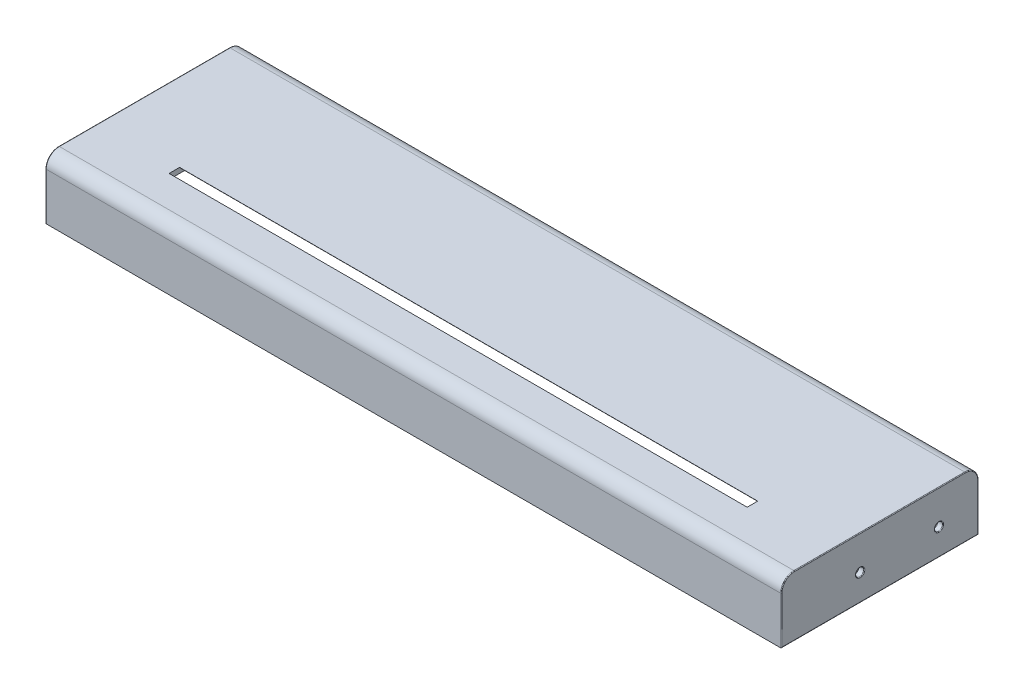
ISO-10303-21;
HEADER;
FILE_DESCRIPTION(('STEP AP214'),'2;1');
FILE_NAME('part.step','',(''),(''),'','','');
FILE_SCHEMA(('AUTOMOTIVE_DESIGN { 1 0 10303 214 1 1 1 1 }'));
ENDSEC;
DATA;
#1=APPLICATION_CONTEXT('core data for automotive mechanical design processes');
#2=APPLICATION_PROTOCOL_DEFINITION('international standard','automotive_design',2000,#1);
#3=PRODUCT_CONTEXT('',#1,'mechanical');
#4=PRODUCT('Part','Part','',(#3));
#5=PRODUCT_RELATED_PRODUCT_CATEGORY('part','',(#4));
#6=PRODUCT_DEFINITION_FORMATION('','',#4);
#7=PRODUCT_DEFINITION_CONTEXT('part definition',#1,'design');
#8=PRODUCT_DEFINITION('design','',#6,#7);
#9=PRODUCT_DEFINITION_SHAPE('','',#8);
#10=(LENGTH_UNIT() NAMED_UNIT(*) SI_UNIT(.MILLI.,.METRE.));
#11=(NAMED_UNIT(*) PLANE_ANGLE_UNIT() SI_UNIT($,.RADIAN.));
#12=(NAMED_UNIT(*) SI_UNIT($,.STERADIAN.) SOLID_ANGLE_UNIT());
#13=UNCERTAINTY_MEASURE_WITH_UNIT(LENGTH_MEASURE(1.E-05),#10,'distance_accuracy_value','');
#14=(GEOMETRIC_REPRESENTATION_CONTEXT(3) GLOBAL_UNCERTAINTY_ASSIGNED_CONTEXT((#13)) GLOBAL_UNIT_ASSIGNED_CONTEXT((#10,
#11,#12)) REPRESENTATION_CONTEXT('',''));
#15=CARTESIAN_POINT('',(0.,0.,0.));
#16=DIRECTION('',(0.,0.,1.));
#17=DIRECTION('',(1.,0.,0.));
#18=AXIS2_PLACEMENT_3D('',#15,#16,#17);
#19=CARTESIAN_POINT('',(280.,11.,37.5));
#20=DIRECTION('',(0.,1.,0.));
#21=DIRECTION('',(0.,0.,1.));
#22=AXIS2_PLACEMENT_3D('',#19,#20,#21);
#23=PLANE('',#22);
#24=DIRECTION('',(-1.,0.,0.));
#25=VECTOR('',#24,1.);
#26=CARTESIAN_POINT('',(280.,11.,-37.5));
#27=LINE('',#26,#25);
#28=CARTESIAN_POINT('',(279.75,11.,-37.5));
#29=VERTEX_POINT('',#28);
#30=CARTESIAN_POINT('',(0.249999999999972,11.,-37.5));
#31=VERTEX_POINT('',#30);
#32=EDGE_CURVE('E272',#29,#31,#27,.T.);
#33=ORIENTED_EDGE('',*,*,#32,.F.);
#34=DIRECTION('',(0.,0.,-1.));
#35=VECTOR('',#34,1.);
#36=CARTESIAN_POINT('',(279.75,11.,37.5));
#37=LINE('',#36,#35);
#38=CARTESIAN_POINT('',(279.75,11.,37.5));
#39=VERTEX_POINT('',#38);
#40=EDGE_CURVE('E327',#29,#39,#37,.F.);
#41=ORIENTED_EDGE('',*,*,#40,.T.);
#42=DIRECTION('',(-1.,0.,0.));
#43=VECTOR('',#42,1.);
#44=CARTESIAN_POINT('',(280.,11.,37.5));
#45=LINE('',#44,#43);
#46=CARTESIAN_POINT('',(0.249999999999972,11.,37.5));
#47=VERTEX_POINT('',#46);
#48=EDGE_CURVE('E275',#39,#47,#45,.T.);
#49=ORIENTED_EDGE('',*,*,#48,.T.);
#50=DIRECTION('',(0.,0.,-1.));
#51=VECTOR('',#50,1.);
#52=CARTESIAN_POINT('',(0.249999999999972,11.,37.5));
#53=LINE('',#52,#51);
#54=EDGE_CURVE('E325',#47,#31,#53,.T.);
#55=ORIENTED_EDGE('',*,*,#54,.T.);
#56=EDGE_LOOP('',(#33,#41,#49,#55));
#57=FACE_BOUND('',#56,.T.);
#58=DIRECTION('',(0.,0.,-1.));
#59=VECTOR('',#58,1.);
#60=CARTESIAN_POINT('',(2.,11.,37.5));
#61=LINE('',#60,#59);
#62=CARTESIAN_POINT('',(2.,11.,35.5));
#63=VERTEX_POINT('',#62);
#64=CARTESIAN_POINT('',(2.,11.,-35.5));
#65=VERTEX_POINT('',#64);
#66=EDGE_CURVE('E237',#63,#65,#61,.T.);
#67=ORIENTED_EDGE('',*,*,#66,.F.);
#68=DIRECTION('',(-1.,0.,0.));
#69=VECTOR('',#68,1.);
#70=CARTESIAN_POINT('',(280.,11.,35.5));
#71=LINE('',#70,#69);
#72=CARTESIAN_POINT('',(278.,11.,35.5));
#73=VERTEX_POINT('',#72);
#74=EDGE_CURVE('E225',#73,#63,#71,.T.);
#75=ORIENTED_EDGE('',*,*,#74,.F.);
#76=DIRECTION('',(0.,0.,-1.));
#77=VECTOR('',#76,1.);
#78=CARTESIAN_POINT('',(278.,11.,37.5));
#79=LINE('',#78,#77);
#80=CARTESIAN_POINT('',(278.,11.,-35.5));
#81=VERTEX_POINT('',#80);
#82=EDGE_CURVE('E240',#73,#81,#79,.T.);
#83=ORIENTED_EDGE('',*,*,#82,.T.);
#84=DIRECTION('',(-1.,0.,0.));
#85=VECTOR('',#84,1.);
#86=CARTESIAN_POINT('',(280.,11.,-35.5));
#87=LINE('',#86,#85);
#88=EDGE_CURVE('E252',#81,#65,#87,.T.);
#89=ORIENTED_EDGE('',*,*,#88,.T.);
#90=EDGE_LOOP('',(#67,#75,#83,#89));
#91=FACE_BOUND('',#90,.T.);
#92=ADVANCED_FACE('F33',(#57,#91),#23,.F.);
#93=CARTESIAN_POINT('',(280.,29.,32.5));
#94=DIRECTION('',(-1.,0.,0.));
#95=DIRECTION('',(0.,0.,1.));
#96=AXIS2_PLACEMENT_3D('',#93,#94,#95);
#97=CYLINDRICAL_SURFACE('',#96,5.);
#98=DIRECTION('',(-1.,0.,0.));
#99=VECTOR('',#98,1.);
#100=CARTESIAN_POINT('',(280.,29.,37.5));
#101=LINE('',#100,#99);
#102=CARTESIAN_POINT('',(279.75,29.,37.5));
#103=VERTEX_POINT('',#102);
#104=CARTESIAN_POINT('',(0.249999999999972,29.,37.5));
#105=VERTEX_POINT('',#104);
#106=EDGE_CURVE('E278',#103,#105,#101,.T.);
#107=ORIENTED_EDGE('',*,*,#106,.F.);
#108=CARTESIAN_POINT('',(279.75,29.,32.5));
#109=DIRECTION('',(1.,0.,0.));
#110=DIRECTION('',(0.,0.,-1.));
#111=AXIS2_PLACEMENT_3D('',#108,#109,#110);
#112=CIRCLE('',#111,5.);
#113=CARTESIAN_POINT('',(279.75,34.,32.5));
#114=VERTEX_POINT('',#113);
#115=EDGE_CURVE('E336',#103,#114,#112,.F.);
#116=ORIENTED_EDGE('',*,*,#115,.T.);
#117=DIRECTION('',(-1.,0.,0.));
#118=VECTOR('',#117,1.);
#119=CARTESIAN_POINT('',(280.,34.,32.5));
#120=LINE('',#119,#118);
#121=CARTESIAN_POINT('',(0.249999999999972,34.,32.5));
#122=VERTEX_POINT('',#121);
#123=EDGE_CURVE('E224',#114,#122,#120,.T.);
#124=ORIENTED_EDGE('',*,*,#123,.T.);
#125=CARTESIAN_POINT('',(0.249999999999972,29.,32.5));
#126=DIRECTION('',(1.,0.,0.));
#127=DIRECTION('',(0.,0.,-1.));
#128=AXIS2_PLACEMENT_3D('',#125,#126,#127);
#129=CIRCLE('',#128,5.);
#130=EDGE_CURVE('E334',#122,#105,#129,.T.);
#131=ORIENTED_EDGE('',*,*,#130,.T.);
#132=EDGE_LOOP('',(#107,#116,#124,#131));
#133=FACE_BOUND('',#132,.T.);
#134=ADVANCED_FACE('F414',(#133),#97,.T.);
#135=CARTESIAN_POINT('',(280.,29.,37.5));
#136=DIRECTION('',(0.,0.,-1.));
#137=DIRECTION('',(-1.,0.,0.));
#138=AXIS2_PLACEMENT_3D('',#135,#136,#137);
#139=PLANE('',#138);
#140=ORIENTED_EDGE('',*,*,#48,.F.);
#141=DIRECTION('',(0.,-1.,0.));
#142=VECTOR('',#141,1.);
#143=CARTESIAN_POINT('',(279.75,29.,37.5));
#144=LINE('',#143,#142);
#145=EDGE_CURVE('E332',#39,#103,#144,.F.);
#146=ORIENTED_EDGE('',*,*,#145,.T.);
#147=ORIENTED_EDGE('',*,*,#106,.T.);
#148=DIRECTION('',(0.,-1.,0.));
#149=VECTOR('',#148,1.);
#150=CARTESIAN_POINT('',(0.249999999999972,29.,37.5));
#151=LINE('',#150,#149);
#152=EDGE_CURVE('E329',#105,#47,#151,.T.);
#153=ORIENTED_EDGE('',*,*,#152,.T.);
#154=EDGE_LOOP('',(#140,#146,#147,#153));
#155=FACE_BOUND('',#154,.T.);
#156=ADVANCED_FACE('F419',(#155),#139,.F.);
#157=CARTESIAN_POINT('',(280.,29.,-37.5));
#158=DIRECTION('',(0.,0.,1.));
#159=DIRECTION('',(1.,0.,0.));
#160=AXIS2_PLACEMENT_3D('',#157,#158,#159);
#161=PLANE('',#160);
#162=DIRECTION('',(-1.,0.,0.));
#163=VECTOR('',#162,1.);
#164=CARTESIAN_POINT('',(280.,29.,-37.5));
#165=LINE('',#164,#163);
#166=CARTESIAN_POINT('',(279.75,29.,-37.5));
#167=VERTEX_POINT('',#166);
#168=CARTESIAN_POINT('',(0.249999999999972,29.,-37.5));
#169=VERTEX_POINT('',#168);
#170=EDGE_CURVE('E269',#167,#169,#165,.T.);
#171=ORIENTED_EDGE('',*,*,#170,.F.);
#172=DIRECTION('',(0.,1.,0.));
#173=VECTOR('',#172,1.);
#174=CARTESIAN_POINT('',(279.75,11.,-37.5));
#175=LINE('',#174,#173);
#176=EDGE_CURVE('E323',#167,#29,#175,.F.);
#177=ORIENTED_EDGE('',*,*,#176,.T.);
#178=ORIENTED_EDGE('',*,*,#32,.T.);
#179=DIRECTION('',(0.,1.,0.));
#180=VECTOR('',#179,1.);
#181=CARTESIAN_POINT('',(0.249999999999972,29.,-37.5));
#182=LINE('',#181,#180);
#183=EDGE_CURVE('E321',#31,#169,#182,.T.);
#184=ORIENTED_EDGE('',*,*,#183,.T.);
#185=EDGE_LOOP('',(#171,#177,#178,#184));
#186=FACE_BOUND('',#185,.T.);
#187=ADVANCED_FACE('F446',(#186),#161,.F.);
#188=CARTESIAN_POINT('',(280.,29.,-32.5));
#189=DIRECTION('',(-1.,0.,0.));
#190=DIRECTION('',(0.,0.,1.));
#191=AXIS2_PLACEMENT_3D('',#188,#189,#190);
#192=CYLINDRICAL_SURFACE('',#191,5.);
#193=DIRECTION('',(-1.,0.,0.));
#194=VECTOR('',#193,1.);
#195=CARTESIAN_POINT('',(280.,34.,-32.5));
#196=LINE('',#195,#194);
#197=CARTESIAN_POINT('',(279.75,34.,-32.5));
#198=VERTEX_POINT('',#197);
#199=CARTESIAN_POINT('',(0.249999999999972,34.,-32.5));
#200=VERTEX_POINT('',#199);
#201=EDGE_CURVE('E266',#198,#200,#196,.T.);
#202=ORIENTED_EDGE('',*,*,#201,.F.);
#203=CARTESIAN_POINT('',(279.75,29.,-32.5));
#204=DIRECTION('',(1.,0.,0.));
#205=DIRECTION('',(0.,0.,-1.));
#206=AXIS2_PLACEMENT_3D('',#203,#204,#205);
#207=CIRCLE('',#206,5.);
#208=EDGE_CURVE('E319',#198,#167,#207,.F.);
#209=ORIENTED_EDGE('',*,*,#208,.T.);
#210=ORIENTED_EDGE('',*,*,#170,.T.);
#211=CARTESIAN_POINT('',(0.249999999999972,29.,-32.5));
#212=DIRECTION('',(1.,0.,0.));
#213=DIRECTION('',(0.,0.,-1.));
#214=AXIS2_PLACEMENT_3D('',#211,#212,#213);
#215=CIRCLE('',#214,5.);
#216=EDGE_CURVE('E317',#169,#200,#215,.T.);
#217=ORIENTED_EDGE('',*,*,#216,.T.);
#218=EDGE_LOOP('',(#202,#209,#210,#217));
#219=FACE_BOUND('',#218,.T.);
#220=ADVANCED_FACE('F443',(#219),#192,.T.);
#221=CARTESIAN_POINT('',(280.,34.,32.5));
#222=DIRECTION('',(0.,-1.,0.));
#223=DIRECTION('',(0.,0.,-1.));
#224=AXIS2_PLACEMENT_3D('',#221,#222,#223);
#225=PLANE('',#224);
#226=DIRECTION('',(-1.,0.,0.));
#227=VECTOR('',#226,1.);
#228=CARTESIAN_POINT('',(30.,34.,16.5));
#229=LINE('',#228,#227);
#230=CARTESIAN_POINT('',(250.,34.,16.5));
#231=VERTEX_POINT('',#230);
#232=CARTESIAN_POINT('',(30.,34.,16.5));
#233=VERTEX_POINT('',#232);
#234=EDGE_CURVE('E203',#231,#233,#229,.T.);
#235=ORIENTED_EDGE('',*,*,#234,.F.);
#236=DIRECTION('',(0.,0.,-1.));
#237=VECTOR('',#236,1.);
#238=CARTESIAN_POINT('',(250.,34.,20.5));
#239=LINE('',#238,#237);
#240=CARTESIAN_POINT('',(250.,34.,20.5));
#241=VERTEX_POINT('',#240);
#242=EDGE_CURVE('E210',#241,#231,#239,.T.);
#243=ORIENTED_EDGE('',*,*,#242,.F.);
#244=DIRECTION('',(1.,0.,0.));
#245=VECTOR('',#244,1.);
#246=CARTESIAN_POINT('',(30.,34.,20.5));
#247=LINE('',#246,#245);
#248=CARTESIAN_POINT('',(30.,34.,20.5));
#249=VERTEX_POINT('',#248);
#250=EDGE_CURVE('E205',#249,#241,#247,.T.);
#251=ORIENTED_EDGE('',*,*,#250,.F.);
#252=DIRECTION('',(0.,0.,1.));
#253=VECTOR('',#252,1.);
#254=CARTESIAN_POINT('',(30.,34.,20.5));
#255=LINE('',#254,#253);
#256=EDGE_CURVE('E188',#233,#249,#255,.T.);
#257=ORIENTED_EDGE('',*,*,#256,.F.);
#258=EDGE_LOOP('',(#235,#243,#251,#257));
#259=FACE_BOUND('',#258,.T.);
#260=ORIENTED_EDGE('',*,*,#123,.F.);
#261=DIRECTION('',(0.,0.,1.));
#262=VECTOR('',#261,1.);
#263=CARTESIAN_POINT('',(279.75,34.,-32.5));
#264=LINE('',#263,#262);
#265=EDGE_CURVE('E314',#114,#198,#264,.F.);
#266=ORIENTED_EDGE('',*,*,#265,.T.);
#267=ORIENTED_EDGE('',*,*,#201,.T.);
#268=DIRECTION('',(0.,0.,1.));
#269=VECTOR('',#268,1.);
#270=CARTESIAN_POINT('',(0.249999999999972,34.,32.5));
#271=LINE('',#270,#269);
#272=EDGE_CURVE('E312',#200,#122,#271,.T.);
#273=ORIENTED_EDGE('',*,*,#272,.T.);
#274=EDGE_LOOP('',(#260,#266,#267,#273));
#275=FACE_BOUND('',#274,.T.);
#276=ADVANCED_FACE('F200',(#259,#275),#225,.F.);
#277=CARTESIAN_POINT('',(280.,29.,32.5));
#278=DIRECTION('',(1.,0.,0.));
#279=DIRECTION('',(0.,0.,-1.));
#280=AXIS2_PLACEMENT_3D('',#277,#278,#279);
#281=PLANE('',#280);
#282=CARTESIAN_POINT('',(280.,29.,-32.5));
#283=DIRECTION('',(1.,0.,0.));
#284=DIRECTION('',(0.,0.,-1.));
#285=AXIS2_PLACEMENT_3D('',#282,#283,#284);
#286=CIRCLE('',#285,4.75);
#287=CARTESIAN_POINT('',(280.,29.,-37.25));
#288=VERTEX_POINT('',#287);
#289=CARTESIAN_POINT('',(280.,33.75,-32.5));
#290=VERTEX_POINT('',#289);
#291=EDGE_CURVE('E307',#288,#290,#286,.T.);
#292=ORIENTED_EDGE('',*,*,#291,.T.);
#293=DIRECTION('',(0.,0.,1.));
#294=VECTOR('',#293,1.);
#295=CARTESIAN_POINT('',(280.,33.75,32.5));
#296=LINE('',#295,#294);
#297=CARTESIAN_POINT('',(280.,33.75,32.5));
#298=VERTEX_POINT('',#297);
#299=EDGE_CURVE('E309',#290,#298,#296,.T.);
#300=ORIENTED_EDGE('',*,*,#299,.T.);
#301=CARTESIAN_POINT('',(280.,29.,32.5));
#302=DIRECTION('',(1.,0.,0.));
#303=DIRECTION('',(0.,0.,-1.));
#304=AXIS2_PLACEMENT_3D('',#301,#302,#303);
#305=CIRCLE('',#304,4.75);
#306=CARTESIAN_POINT('',(280.,29.,37.25));
#307=VERTEX_POINT('',#306);
#308=EDGE_CURVE('E299',#298,#307,#305,.T.);
#309=ORIENTED_EDGE('',*,*,#308,.T.);
#310=DIRECTION('',(0.,-1.,0.));
#311=VECTOR('',#310,1.);
#312=CARTESIAN_POINT('',(280.,11.,37.25));
#313=LINE('',#312,#311);
#314=CARTESIAN_POINT('',(280.,11.25,37.25));
#315=VERTEX_POINT('',#314);
#316=EDGE_CURVE('E301',#307,#315,#313,.T.);
#317=ORIENTED_EDGE('',*,*,#316,.T.);
#318=DIRECTION('',(0.,0.,-1.));
#319=VECTOR('',#318,1.);
#320=CARTESIAN_POINT('',(280.,11.25,-37.5));
#321=LINE('',#320,#319);
#322=CARTESIAN_POINT('',(280.,11.25,-37.25));
#323=VERTEX_POINT('',#322);
#324=EDGE_CURVE('E303',#315,#323,#321,.T.);
#325=ORIENTED_EDGE('',*,*,#324,.T.);
#326=DIRECTION('',(0.,1.,0.));
#327=VECTOR('',#326,1.);
#328=CARTESIAN_POINT('',(280.,29.,-37.25));
#329=LINE('',#328,#327);
#330=EDGE_CURVE('E305',#323,#288,#329,.T.);
#331=ORIENTED_EDGE('',*,*,#330,.T.);
#332=EDGE_LOOP('',(#292,#300,#309,#317,#325,#331));
#333=FACE_BOUND('',#332,.T.);
#334=CARTESIAN_POINT('',(280.,21.,-22.5));
#335=DIRECTION('',(1.,0.,0.));
#336=DIRECTION('',(0.,0.,-1.));
#337=AXIS2_PLACEMENT_3D('',#334,#335,#336);
#338=CIRCLE('',#337,1.8);
#339=CARTESIAN_POINT('',(280.,21.,-24.3));
#340=VERTEX_POINT('',#339);
#341=EDGE_CURVE('E296',#340,#340,#338,.F.);
#342=ORIENTED_EDGE('',*,*,#341,.T.);
#343=EDGE_LOOP('',(#342));
#344=FACE_BOUND('',#343,.T.);
#345=CARTESIAN_POINT('',(280.,21.,7.50000000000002));
#346=DIRECTION('',(1.,0.,0.));
#347=DIRECTION('',(0.,0.,-1.));
#348=AXIS2_PLACEMENT_3D('',#345,#346,#347);
#349=CIRCLE('',#348,1.8);
#350=CARTESIAN_POINT('',(280.,21.,5.70000000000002));
#351=VERTEX_POINT('',#350);
#352=EDGE_CURVE('E195',#351,#351,#349,.F.);
#353=ORIENTED_EDGE('',*,*,#352,.T.);
#354=EDGE_LOOP('',(#353));
#355=FACE_BOUND('',#354,.T.);
#356=ADVANCED_FACE('F584',(#333,#344,#355),#281,.T.);
#357=CARTESIAN_POINT('',(0.,29.,32.5));
#358=DIRECTION('',(1.,0.,0.));
#359=DIRECTION('',(0.,0.,-1.));
#360=AXIS2_PLACEMENT_3D('',#357,#358,#359);
#361=PLANE('',#360);
#362=DIRECTION('',(0.,0.,-1.));
#363=VECTOR('',#362,1.);
#364=CARTESIAN_POINT('',(0.,11.25,32.5));
#365=LINE('',#364,#363);
#366=CARTESIAN_POINT('',(0.,11.25,-37.25));
#367=VERTEX_POINT('',#366);
#368=CARTESIAN_POINT('',(0.,11.25,37.25));
#369=VERTEX_POINT('',#368);
#370=EDGE_CURVE('E50',#367,#369,#365,.F.);
#371=ORIENTED_EDGE('',*,*,#370,.T.);
#372=DIRECTION('',(0.,-1.,0.));
#373=VECTOR('',#372,1.);
#374=CARTESIAN_POINT('',(0.,29.,37.25));
#375=LINE('',#374,#373);
#376=CARTESIAN_POINT('',(0.,29.,37.25));
#377=VERTEX_POINT('',#376);
#378=EDGE_CURVE('E358',#369,#377,#375,.F.);
#379=ORIENTED_EDGE('',*,*,#378,.T.);
#380=CARTESIAN_POINT('',(0.,29.,32.5));
#381=DIRECTION('',(1.,0.,0.));
#382=DIRECTION('',(0.,0.,-1.));
#383=AXIS2_PLACEMENT_3D('',#380,#381,#382);
#384=CIRCLE('',#383,4.75);
#385=CARTESIAN_POINT('',(0.,33.75,32.5));
#386=VERTEX_POINT('',#385);
#387=EDGE_CURVE('E350',#377,#386,#384,.F.);
#388=ORIENTED_EDGE('',*,*,#387,.T.);
#389=DIRECTION('',(0.,0.,1.));
#390=VECTOR('',#389,1.);
#391=CARTESIAN_POINT('',(0.,33.75,32.5));
#392=LINE('',#391,#390);
#393=CARTESIAN_POINT('',(0.,33.75,-32.5));
#394=VERTEX_POINT('',#393);
#395=EDGE_CURVE('E352',#386,#394,#392,.F.);
#396=ORIENTED_EDGE('',*,*,#395,.T.);
#397=CARTESIAN_POINT('',(0.,29.,-32.5));
#398=DIRECTION('',(1.,0.,0.));
#399=DIRECTION('',(0.,0.,-1.));
#400=AXIS2_PLACEMENT_3D('',#397,#398,#399);
#401=CIRCLE('',#400,4.75);
#402=CARTESIAN_POINT('',(0.,29.,-37.25));
#403=VERTEX_POINT('',#402);
#404=EDGE_CURVE('E354',#394,#403,#401,.F.);
#405=ORIENTED_EDGE('',*,*,#404,.T.);
#406=DIRECTION('',(0.,1.,0.));
#407=VECTOR('',#406,1.);
#408=CARTESIAN_POINT('',(0.,29.,-37.25));
#409=LINE('',#408,#407);
#410=EDGE_CURVE('E55',#403,#367,#409,.F.);
#411=ORIENTED_EDGE('',*,*,#410,.T.);
#412=EDGE_LOOP('',(#371,#379,#388,#396,#405,#411));
#413=FACE_BOUND('',#412,.T.);
#414=CARTESIAN_POINT('',(0.,21.,-22.5));
#415=DIRECTION('',(1.,0.,0.));
#416=DIRECTION('',(0.,0.,-1.));
#417=AXIS2_PLACEMENT_3D('',#414,#415,#416);
#418=CIRCLE('',#417,1.8);
#419=CARTESIAN_POINT('',(0.,21.,-24.3));
#420=VERTEX_POINT('',#419);
#421=EDGE_CURVE('E347',#420,#420,#418,.T.);
#422=ORIENTED_EDGE('',*,*,#421,.T.);
#423=EDGE_LOOP('',(#422));
#424=FACE_BOUND('',#423,.T.);
#425=CARTESIAN_POINT('',(0.,21.,7.50000000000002));
#426=DIRECTION('',(1.,0.,0.));
#427=DIRECTION('',(0.,0.,-1.));
#428=AXIS2_PLACEMENT_3D('',#425,#426,#427);
#429=CIRCLE('',#428,1.8);
#430=CARTESIAN_POINT('',(0.,21.,5.70000000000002));
#431=VERTEX_POINT('',#430);
#432=EDGE_CURVE('E344',#431,#431,#429,.T.);
#433=ORIENTED_EDGE('',*,*,#432,.T.);
#434=EDGE_LOOP('',(#433));
#435=FACE_BOUND('',#434,.T.);
#436=ADVANCED_FACE('F404',(#413,#424,#435),#361,.F.);
#437=CARTESIAN_POINT('',(280.,29.,32.5));
#438=DIRECTION('',(-1.,0.,0.));
#439=DIRECTION('',(0.,0.,1.));
#440=AXIS2_PLACEMENT_3D('',#437,#438,#439);
#441=CYLINDRICAL_SURFACE('',#440,3.);
#442=CARTESIAN_POINT('',(2.,29.,32.5));
#443=DIRECTION('',(1.,0.,0.));
#444=DIRECTION('',(0.,0.,-1.));
#445=AXIS2_PLACEMENT_3D('',#442,#443,#444);
#446=CIRCLE('',#445,3.);
#447=CARTESIAN_POINT('',(2.,32.,32.5));
#448=VERTEX_POINT('',#447);
#449=CARTESIAN_POINT('',(2.,29.,35.5));
#450=VERTEX_POINT('',#449);
#451=EDGE_CURVE('E217',#448,#450,#446,.T.);
#452=ORIENTED_EDGE('',*,*,#451,.F.);
#453=DIRECTION('',(-1.,0.,0.));
#454=VECTOR('',#453,1.);
#455=CARTESIAN_POINT('',(280.,32.,32.5));
#456=LINE('',#455,#454);
#457=CARTESIAN_POINT('',(278.,32.,32.5));
#458=VERTEX_POINT('',#457);
#459=EDGE_CURVE('E231',#458,#448,#456,.T.);
#460=ORIENTED_EDGE('',*,*,#459,.F.);
#461=CARTESIAN_POINT('',(278.,29.,32.5));
#462=DIRECTION('',(1.,0.,0.));
#463=DIRECTION('',(0.,0.,-1.));
#464=AXIS2_PLACEMENT_3D('',#461,#462,#463);
#465=CIRCLE('',#464,3.);
#466=CARTESIAN_POINT('',(278.,29.,35.5));
#467=VERTEX_POINT('',#466);
#468=EDGE_CURVE('E226',#458,#467,#465,.T.);
#469=ORIENTED_EDGE('',*,*,#468,.T.);
#470=DIRECTION('',(-1.,0.,0.));
#471=VECTOR('',#470,1.);
#472=CARTESIAN_POINT('',(280.,29.,35.5));
#473=LINE('',#472,#471);
#474=EDGE_CURVE('E221',#467,#450,#473,.T.);
#475=ORIENTED_EDGE('',*,*,#474,.T.);
#476=EDGE_LOOP('',(#452,#460,#469,#475));
#477=FACE_BOUND('',#476,.T.);
#478=ADVANCED_FACE('F559',(#477),#441,.F.);
#479=CARTESIAN_POINT('',(280.,29.,35.5));
#480=DIRECTION('',(0.,0.,-1.));
#481=DIRECTION('',(-1.,0.,0.));
#482=AXIS2_PLACEMENT_3D('',#479,#480,#481);
#483=PLANE('',#482);
#484=DIRECTION('',(0.,-1.,0.));
#485=VECTOR('',#484,1.);
#486=CARTESIAN_POINT('',(2.,29.,35.5));
#487=LINE('',#486,#485);
#488=EDGE_CURVE('E220',#450,#63,#487,.T.);
#489=ORIENTED_EDGE('',*,*,#488,.F.);
#490=ORIENTED_EDGE('',*,*,#474,.F.);
#491=DIRECTION('',(0.,-1.,0.));
#492=VECTOR('',#491,1.);
#493=CARTESIAN_POINT('',(278.,29.,35.5));
#494=LINE('',#493,#492);
#495=EDGE_CURVE('E229',#467,#73,#494,.T.);
#496=ORIENTED_EDGE('',*,*,#495,.T.);
#497=ORIENTED_EDGE('',*,*,#74,.T.);
#498=EDGE_LOOP('',(#489,#490,#496,#497));
#499=FACE_BOUND('',#498,.T.);
#500=ADVANCED_FACE('F562',(#499),#483,.T.);
#501=CARTESIAN_POINT('',(280.,29.,-35.5));
#502=DIRECTION('',(0.,0.,1.));
#503=DIRECTION('',(1.,0.,0.));
#504=AXIS2_PLACEMENT_3D('',#501,#502,#503);
#505=PLANE('',#504);
#506=DIRECTION('',(0.,1.,0.));
#507=VECTOR('',#506,1.);
#508=CARTESIAN_POINT('',(2.,29.,-35.5));
#509=LINE('',#508,#507);
#510=CARTESIAN_POINT('',(2.,29.,-35.5));
#511=VERTEX_POINT('',#510);
#512=EDGE_CURVE('E246',#65,#511,#509,.T.);
#513=ORIENTED_EDGE('',*,*,#512,.F.);
#514=ORIENTED_EDGE('',*,*,#88,.F.);
#515=DIRECTION('',(0.,1.,0.));
#516=VECTOR('',#515,1.);
#517=CARTESIAN_POINT('',(278.,29.,-35.5));
#518=LINE('',#517,#516);
#519=CARTESIAN_POINT('',(278.,29.,-35.5));
#520=VERTEX_POINT('',#519);
#521=EDGE_CURVE('E241',#81,#520,#518,.T.);
#522=ORIENTED_EDGE('',*,*,#521,.T.);
#523=DIRECTION('',(-1.,0.,0.));
#524=VECTOR('',#523,1.);
#525=CARTESIAN_POINT('',(280.,29.,-35.5));
#526=LINE('',#525,#524);
#527=EDGE_CURVE('E249',#520,#511,#526,.T.);
#528=ORIENTED_EDGE('',*,*,#527,.T.);
#529=EDGE_LOOP('',(#513,#514,#522,#528));
#530=FACE_BOUND('',#529,.T.);
#531=ADVANCED_FACE('F566',(#530),#505,.T.);
#532=CARTESIAN_POINT('',(280.,29.,-32.5));
#533=DIRECTION('',(-1.,0.,0.));
#534=DIRECTION('',(0.,0.,1.));
#535=AXIS2_PLACEMENT_3D('',#532,#533,#534);
#536=CYLINDRICAL_SURFACE('',#535,3.);
#537=CARTESIAN_POINT('',(2.,29.,-32.5));
#538=DIRECTION('',(1.,0.,0.));
#539=DIRECTION('',(0.,0.,-1.));
#540=AXIS2_PLACEMENT_3D('',#537,#538,#539);
#541=CIRCLE('',#540,3.);
#542=CARTESIAN_POINT('',(2.,32.,-32.5));
#543=VERTEX_POINT('',#542);
#544=EDGE_CURVE('E248',#511,#543,#541,.T.);
#545=ORIENTED_EDGE('',*,*,#544,.F.);
#546=ORIENTED_EDGE('',*,*,#527,.F.);
#547=CARTESIAN_POINT('',(278.,29.,-32.5));
#548=DIRECTION('',(1.,0.,0.));
#549=DIRECTION('',(0.,0.,-1.));
#550=AXIS2_PLACEMENT_3D('',#547,#548,#549);
#551=CIRCLE('',#550,3.);
#552=CARTESIAN_POINT('',(278.,32.,-32.5));
#553=VERTEX_POINT('',#552);
#554=EDGE_CURVE('E243',#520,#553,#551,.T.);
#555=ORIENTED_EDGE('',*,*,#554,.T.);
#556=DIRECTION('',(1.,0.,0.));
#557=VECTOR('',#556,1.);
#558=CARTESIAN_POINT('',(280.,32.,-32.5));
#559=LINE('',#558,#557);
#560=EDGE_CURVE('E234',#553,#543,#559,.F.);
#561=ORIENTED_EDGE('',*,*,#560,.T.);
#562=EDGE_LOOP('',(#545,#546,#555,#561));
#563=FACE_BOUND('',#562,.T.);
#564=ADVANCED_FACE('F570',(#563),#536,.F.);
#565=CARTESIAN_POINT('',(280.,32.,32.5));
#566=DIRECTION('',(0.,-1.,0.));
#567=DIRECTION('',(0.,0.,-1.));
#568=AXIS2_PLACEMENT_3D('',#565,#566,#567);
#569=PLANE('',#568);
#570=DIRECTION('',(0.,0.,-1.));
#571=VECTOR('',#570,1.);
#572=CARTESIAN_POINT('',(30.,32.,32.5));
#573=LINE('',#572,#571);
#574=CARTESIAN_POINT('',(30.,32.,24.5));
#575=VERTEX_POINT('',#574);
#576=CARTESIAN_POINT('',(30.,32.,12.5));
#577=VERTEX_POINT('',#576);
#578=EDGE_CURVE('E190',#575,#577,#573,.T.);
#579=ORIENTED_EDGE('',*,*,#578,.F.);
#580=DIRECTION('',(-1.,0.,0.));
#581=VECTOR('',#580,1.);
#582=CARTESIAN_POINT('',(250.,32.,24.5));
#583=LINE('',#582,#581);
#584=CARTESIAN_POINT('',(250.,32.,24.5));
#585=VERTEX_POINT('',#584);
#586=EDGE_CURVE('E286',#575,#585,#583,.F.);
#587=ORIENTED_EDGE('',*,*,#586,.T.);
#588=DIRECTION('',(0.,0.,1.));
#589=VECTOR('',#588,1.);
#590=CARTESIAN_POINT('',(250.,32.,32.5));
#591=LINE('',#590,#589);
#592=CARTESIAN_POINT('',(250.,32.,12.5));
#593=VERTEX_POINT('',#592);
#594=EDGE_CURVE('E282',#593,#585,#591,.T.);
#595=ORIENTED_EDGE('',*,*,#594,.F.);
#596=DIRECTION('',(1.,0.,0.));
#597=VECTOR('',#596,1.);
#598=CARTESIAN_POINT('',(30.,32.,12.5));
#599=LINE('',#598,#597);
#600=EDGE_CURVE('E284',#593,#577,#599,.F.);
#601=ORIENTED_EDGE('',*,*,#600,.T.);
#602=EDGE_LOOP('',(#579,#587,#595,#601));
#603=FACE_BOUND('',#602,.T.);
#604=DIRECTION('',(0.,0.,1.));
#605=VECTOR('',#604,1.);
#606=CARTESIAN_POINT('',(2.,32.,32.5));
#607=LINE('',#606,#605);
#608=EDGE_CURVE('E230',#543,#448,#607,.T.);
#609=ORIENTED_EDGE('',*,*,#608,.F.);
#610=ORIENTED_EDGE('',*,*,#560,.F.);
#611=DIRECTION('',(0.,0.,1.));
#612=VECTOR('',#611,1.);
#613=CARTESIAN_POINT('',(278.,32.,32.5));
#614=LINE('',#613,#612);
#615=EDGE_CURVE('E235',#553,#458,#614,.T.);
#616=ORIENTED_EDGE('',*,*,#615,.T.);
#617=ORIENTED_EDGE('',*,*,#459,.T.);
#618=EDGE_LOOP('',(#609,#610,#616,#617));
#619=FACE_BOUND('',#618,.T.);
#620=ADVANCED_FACE('F574',(#603,#619),#569,.T.);
#621=CARTESIAN_POINT('',(278.,29.,32.5));
#622=DIRECTION('',(1.,0.,0.));
#623=DIRECTION('',(0.,0.,-1.));
#624=AXIS2_PLACEMENT_3D('',#621,#622,#623);
#625=PLANE('',#624);
#626=CARTESIAN_POINT('',(278.,21.,7.50000000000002));
#627=DIRECTION('',(1.,0.,0.));
#628=DIRECTION('',(0.,0.,-1.));
#629=AXIS2_PLACEMENT_3D('',#626,#627,#628);
#630=CIRCLE('',#629,1.55);
#631=CARTESIAN_POINT('',(278.,21.,5.95000000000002));
#632=VERTEX_POINT('',#631);
#633=EDGE_CURVE('E527',#632,#632,#630,.F.);
#634=ORIENTED_EDGE('',*,*,#633,.F.);
#635=EDGE_LOOP('',(#634));
#636=FACE_BOUND('',#635,.T.);
#637=CARTESIAN_POINT('',(278.,21.,-22.5));
#638=DIRECTION('',(1.,0.,0.));
#639=DIRECTION('',(0.,0.,-1.));
#640=AXIS2_PLACEMENT_3D('',#637,#638,#639);
#641=CIRCLE('',#640,1.55);
#642=CARTESIAN_POINT('',(278.,21.,-24.05));
#643=VERTEX_POINT('',#642);
#644=EDGE_CURVE('E212',#643,#643,#641,.F.);
#645=ORIENTED_EDGE('',*,*,#644,.F.);
#646=EDGE_LOOP('',(#645));
#647=FACE_BOUND('',#646,.T.);
#648=ORIENTED_EDGE('',*,*,#468,.F.);
#649=ORIENTED_EDGE('',*,*,#615,.F.);
#650=ORIENTED_EDGE('',*,*,#554,.F.);
#651=ORIENTED_EDGE('',*,*,#521,.F.);
#652=ORIENTED_EDGE('',*,*,#82,.F.);
#653=ORIENTED_EDGE('',*,*,#495,.F.);
#654=EDGE_LOOP('',(#648,#649,#650,#651,#652,#653));
#655=FACE_BOUND('',#654,.T.);
#656=ADVANCED_FACE('F578',(#636,#647,#655),#625,.F.);
#657=CARTESIAN_POINT('',(2.,29.,32.5));
#658=DIRECTION('',(1.,0.,0.));
#659=DIRECTION('',(0.,0.,-1.));
#660=AXIS2_PLACEMENT_3D('',#657,#658,#659);
#661=PLANE('',#660);
#662=CARTESIAN_POINT('',(2.,21.,7.50000000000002));
#663=DIRECTION('',(1.,0.,0.));
#664=DIRECTION('',(0.,0.,-1.));
#665=AXIS2_PLACEMENT_3D('',#662,#663,#664);
#666=CIRCLE('',#665,1.55);
#667=CARTESIAN_POINT('',(2.,21.,5.95000000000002));
#668=VERTEX_POINT('',#667);
#669=EDGE_CURVE('E378',#668,#668,#666,.F.);
#670=ORIENTED_EDGE('',*,*,#669,.T.);
#671=EDGE_LOOP('',(#670));
#672=FACE_BOUND('',#671,.T.);
#673=CARTESIAN_POINT('',(2.,21.,-22.5));
#674=DIRECTION('',(1.,0.,0.));
#675=DIRECTION('',(0.,0.,-1.));
#676=AXIS2_PLACEMENT_3D('',#673,#674,#675);
#677=CIRCLE('',#676,1.55);
#678=CARTESIAN_POINT('',(2.,21.,-24.05));
#679=VERTEX_POINT('',#678);
#680=EDGE_CURVE('E529',#679,#679,#677,.F.);
#681=ORIENTED_EDGE('',*,*,#680,.T.);
#682=EDGE_LOOP('',(#681));
#683=FACE_BOUND('',#682,.T.);
#684=ORIENTED_EDGE('',*,*,#451,.T.);
#685=ORIENTED_EDGE('',*,*,#488,.T.);
#686=ORIENTED_EDGE('',*,*,#66,.T.);
#687=ORIENTED_EDGE('',*,*,#512,.T.);
#688=ORIENTED_EDGE('',*,*,#544,.T.);
#689=ORIENTED_EDGE('',*,*,#608,.T.);
#690=EDGE_LOOP('',(#684,#685,#686,#687,#688,#689));
#691=FACE_BOUND('',#690,.T.);
#692=ADVANCED_FACE('F538',(#672,#683,#691),#661,.T.);
#693=CARTESIAN_POINT('',(250.,24.,20.5));
#694=DIRECTION('',(1.,0.,0.));
#695=DIRECTION('',(0.,0.,-1.));
#696=AXIS2_PLACEMENT_3D('',#693,#694,#695);
#697=PLANE('',#696);
#698=ORIENTED_EDGE('',*,*,#594,.T.);
#699=CARTESIAN_POINT('',(250.,37.,24.5));
#700=DIRECTION('',(1.,0.,0.));
#701=DIRECTION('',(0.,0.,-1.));
#702=AXIS2_PLACEMENT_3D('',#699,#700,#701);
#703=CIRCLE('',#702,5.);
#704=EDGE_CURVE('E291',#585,#241,#703,.T.);
#705=ORIENTED_EDGE('',*,*,#704,.T.);
#706=ORIENTED_EDGE('',*,*,#242,.T.);
#707=CARTESIAN_POINT('',(250.,37.,12.5));
#708=DIRECTION('',(1.,0.,0.));
#709=DIRECTION('',(0.,0.,-1.));
#710=AXIS2_PLACEMENT_3D('',#707,#708,#709);
#711=CIRCLE('',#710,5.);
#712=EDGE_CURVE('E196',#231,#593,#711,.T.);
#713=ORIENTED_EDGE('',*,*,#712,.T.);
#714=EDGE_LOOP('',(#698,#705,#706,#713));
#715=FACE_BOUND('',#714,.T.);
#716=ADVANCED_FACE('F555',(#715),#697,.F.);
#717=CARTESIAN_POINT('',(30.,24.,20.5));
#718=DIRECTION('',(-1.,0.,0.));
#719=DIRECTION('',(0.,0.,1.));
#720=AXIS2_PLACEMENT_3D('',#717,#718,#719);
#721=PLANE('',#720);
#722=ORIENTED_EDGE('',*,*,#578,.T.);
#723=CARTESIAN_POINT('',(30.,37.,12.5));
#724=DIRECTION('',(-1.,0.,0.));
#725=DIRECTION('',(0.,0.,1.));
#726=AXIS2_PLACEMENT_3D('',#723,#724,#725);
#727=CIRCLE('',#726,5.);
#728=EDGE_CURVE('E184',#577,#233,#727,.T.);
#729=ORIENTED_EDGE('',*,*,#728,.T.);
#730=ORIENTED_EDGE('',*,*,#256,.T.);
#731=CARTESIAN_POINT('',(30.,37.,24.5));
#732=DIRECTION('',(-1.,0.,0.));
#733=DIRECTION('',(0.,0.,1.));
#734=AXIS2_PLACEMENT_3D('',#731,#732,#733);
#735=CIRCLE('',#734,5.);
#736=EDGE_CURVE('E289',#249,#575,#735,.T.);
#737=ORIENTED_EDGE('',*,*,#736,.T.);
#738=EDGE_LOOP('',(#722,#729,#730,#737));
#739=FACE_BOUND('',#738,.T.);
#740=ADVANCED_FACE('F186',(#739),#721,.F.);
#741=CARTESIAN_POINT('',(-0.000999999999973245,21.,-22.5));
#742=DIRECTION('',(1.,0.,0.));
#743=DIRECTION('',(0.,0.,-1.));
#744=AXIS2_PLACEMENT_3D('',#741,#742,#743);
#745=CYLINDRICAL_SURFACE('',#744,1.55);
#746=CARTESIAN_POINT('',(279.75,21.,-22.5));
#747=DIRECTION('',(1.,0.,0.));
#748=DIRECTION('',(0.,0.,-1.));
#749=AXIS2_PLACEMENT_3D('',#746,#747,#748);
#750=CIRCLE('',#749,1.55);
#751=CARTESIAN_POINT('',(279.75,21.,-24.05));
#752=VERTEX_POINT('',#751);
#753=EDGE_CURVE('E338',#752,#752,#750,.T.);
#754=ORIENTED_EDGE('',*,*,#753,.T.);
#755=EDGE_LOOP('',(#754));
#756=FACE_BOUND('',#755,.T.);
#757=ORIENTED_EDGE('',*,*,#644,.T.);
#758=EDGE_LOOP('',(#757));
#759=FACE_BOUND('',#758,.T.);
#760=ADVANCED_FACE('F523',(#756,#759),#745,.F.);
#761=CARTESIAN_POINT('',(-0.000999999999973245,21.,7.50000000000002));
#762=DIRECTION('',(1.,0.,0.));
#763=DIRECTION('',(0.,0.,-1.));
#764=AXIS2_PLACEMENT_3D('',#761,#762,#763);
#765=CYLINDRICAL_SURFACE('',#764,1.55);
#766=CARTESIAN_POINT('',(279.75,21.,7.50000000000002));
#767=DIRECTION('',(1.,0.,0.));
#768=DIRECTION('',(0.,0.,-1.));
#769=AXIS2_PLACEMENT_3D('',#766,#767,#768);
#770=CIRCLE('',#769,1.55);
#771=CARTESIAN_POINT('',(279.75,21.,5.95000000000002));
#772=VERTEX_POINT('',#771);
#773=EDGE_CURVE('E341',#772,#772,#770,.T.);
#774=ORIENTED_EDGE('',*,*,#773,.T.);
#775=EDGE_LOOP('',(#774));
#776=FACE_BOUND('',#775,.T.);
#777=ORIENTED_EDGE('',*,*,#633,.T.);
#778=EDGE_LOOP('',(#777));
#779=FACE_BOUND('',#778,.T.);
#780=ADVANCED_FACE('F489',(#776,#779),#765,.F.);
#781=CARTESIAN_POINT('',(30.,37.,24.5));
#782=DIRECTION('',(1.,0.,0.));
#783=DIRECTION('',(0.,0.,-1.));
#784=AXIS2_PLACEMENT_3D('',#781,#782,#783);
#785=CYLINDRICAL_SURFACE('',#784,5.);
#786=ORIENTED_EDGE('',*,*,#704,.F.);
#787=ORIENTED_EDGE('',*,*,#586,.F.);
#788=ORIENTED_EDGE('',*,*,#736,.F.);
#789=ORIENTED_EDGE('',*,*,#250,.T.);
#790=EDGE_LOOP('',(#786,#787,#788,#789));
#791=FACE_BOUND('',#790,.T.);
#792=ADVANCED_FACE('F486',(#791),#785,.T.);
#793=CARTESIAN_POINT('',(30.,37.,12.5));
#794=DIRECTION('',(-1.,0.,0.));
#795=DIRECTION('',(0.,0.,1.));
#796=AXIS2_PLACEMENT_3D('',#793,#794,#795);
#797=CYLINDRICAL_SURFACE('',#796,5.);
#798=ORIENTED_EDGE('',*,*,#728,.F.);
#799=ORIENTED_EDGE('',*,*,#600,.F.);
#800=ORIENTED_EDGE('',*,*,#712,.F.);
#801=ORIENTED_EDGE('',*,*,#234,.T.);
#802=EDGE_LOOP('',(#798,#799,#800,#801));
#803=FACE_BOUND('',#802,.T.);
#804=ADVANCED_FACE('F207',(#803),#797,.T.);
#805=CARTESIAN_POINT('',(280.001,21.,-22.5));
#806=DIRECTION('',(-1.,0.,0.));
#807=DIRECTION('',(0.,0.,1.));
#808=AXIS2_PLACEMENT_3D('',#805,#806,#807);
#809=CYLINDRICAL_SURFACE('',#808,1.55);
#810=CARTESIAN_POINT('',(0.249999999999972,21.,-22.5));
#811=DIRECTION('',(1.,0.,0.));
#812=DIRECTION('',(0.,0.,-1.));
#813=AXIS2_PLACEMENT_3D('',#810,#811,#812);
#814=CIRCLE('',#813,1.55);
#815=CARTESIAN_POINT('',(0.249999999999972,21.,-24.05));
#816=VERTEX_POINT('',#815);
#817=EDGE_CURVE('E42',#816,#816,#814,.F.);
#818=ORIENTED_EDGE('',*,*,#817,.T.);
#819=EDGE_LOOP('',(#818));
#820=FACE_BOUND('',#819,.T.);
#821=ORIENTED_EDGE('',*,*,#680,.F.);
#822=EDGE_LOOP('',(#821));
#823=FACE_BOUND('',#822,.T.);
#824=ADVANCED_FACE('F493',(#820,#823),#809,.F.);
#825=CARTESIAN_POINT('',(280.001,21.,7.50000000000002));
#826=DIRECTION('',(-1.,0.,0.));
#827=DIRECTION('',(0.,0.,1.));
#828=AXIS2_PLACEMENT_3D('',#825,#826,#827);
#829=CYLINDRICAL_SURFACE('',#828,1.55);
#830=CARTESIAN_POINT('',(0.249999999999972,21.,7.50000000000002));
#831=DIRECTION('',(1.,0.,0.));
#832=DIRECTION('',(0.,0.,-1.));
#833=AXIS2_PLACEMENT_3D('',#830,#831,#832);
#834=CIRCLE('',#833,1.55);
#835=CARTESIAN_POINT('',(0.249999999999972,21.,5.95000000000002));
#836=VERTEX_POINT('',#835);
#837=EDGE_CURVE('E11',#836,#836,#834,.F.);
#838=ORIENTED_EDGE('',*,*,#837,.T.);
#839=EDGE_LOOP('',(#838));
#840=FACE_BOUND('',#839,.T.);
#841=ORIENTED_EDGE('',*,*,#669,.F.);
#842=EDGE_LOOP('',(#841));
#843=FACE_BOUND('',#842,.T.);
#844=ADVANCED_FACE('F507',(#840,#843),#829,.F.);
#845=CARTESIAN_POINT('',(279.75,11.25,32.5));
#846=DIRECTION('',(0.,0.,1.));
#847=DIRECTION('',(1.,0.,0.));
#848=AXIS2_PLACEMENT_3D('',#845,#846,#847);
#849=CYLINDRICAL_SURFACE('',#848,0.25);
#850=CARTESIAN_POINT('',(279.75,11.25,37.25));
#851=DIRECTION('',(0.,0.707106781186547,0.707106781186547));
#852=DIRECTION('',(0.,0.707106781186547,-0.707106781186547));
#853=AXIS2_PLACEMENT_3D('',#850,#851,#852);
#854=ELLIPSE('',#853,0.353553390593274,0.25);
#855=EDGE_CURVE('E372',#39,#315,#854,.T.);
#856=ORIENTED_EDGE('',*,*,#855,.F.);
#857=ORIENTED_EDGE('',*,*,#40,.F.);
#858=CARTESIAN_POINT('',(279.75,11.25,-37.25));
#859=DIRECTION('',(0.,-0.707106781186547,0.707106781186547));
#860=DIRECTION('',(0.,0.707106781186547,0.707106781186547));
#861=AXIS2_PLACEMENT_3D('',#858,#859,#860);
#862=ELLIPSE('',#861,0.353553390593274,0.25);
#863=EDGE_CURVE('E375',#323,#29,#862,.F.);
#864=ORIENTED_EDGE('',*,*,#863,.F.);
#865=ORIENTED_EDGE('',*,*,#324,.F.);
#866=EDGE_LOOP('',(#856,#857,#864,#865));
#867=FACE_BOUND('',#866,.T.);
#868=ADVANCED_FACE('F455',(#867),#849,.T.);
#869=CARTESIAN_POINT('',(279.75,29.,-37.25));
#870=DIRECTION('',(0.,-1.,0.));
#871=DIRECTION('',(0.,0.,-1.));
#872=AXIS2_PLACEMENT_3D('',#869,#870,#871);
#873=CYLINDRICAL_SURFACE('',#872,0.25);
#874=ORIENTED_EDGE('',*,*,#863,.T.);
#875=ORIENTED_EDGE('',*,*,#176,.F.);
#876=CARTESIAN_POINT('',(279.75,29.,-37.25));
#877=DIRECTION('',(0.,1.,0.));
#878=DIRECTION('',(0.,0.,1.));
#879=AXIS2_PLACEMENT_3D('',#876,#877,#878);
#880=CIRCLE('',#879,0.25);
#881=EDGE_CURVE('E369',#288,#167,#880,.T.);
#882=ORIENTED_EDGE('',*,*,#881,.F.);
#883=ORIENTED_EDGE('',*,*,#330,.F.);
#884=EDGE_LOOP('',(#874,#875,#882,#883));
#885=FACE_BOUND('',#884,.T.);
#886=ADVANCED_FACE('F449',(#885),#873,.T.);
#887=CARTESIAN_POINT('',(279.75,29.,37.25));
#888=DIRECTION('',(0.,1.,0.));
#889=DIRECTION('',(0.,0.,1.));
#890=AXIS2_PLACEMENT_3D('',#887,#888,#889);
#891=CYLINDRICAL_SURFACE('',#890,0.25);
#892=ORIENTED_EDGE('',*,*,#855,.T.);
#893=ORIENTED_EDGE('',*,*,#316,.F.);
#894=CARTESIAN_POINT('',(279.75,29.,37.25));
#895=DIRECTION('',(0.,1.,0.));
#896=DIRECTION('',(0.,0.,1.));
#897=AXIS2_PLACEMENT_3D('',#894,#895,#896);
#898=CIRCLE('',#897,0.25);
#899=EDGE_CURVE('E366',#103,#307,#898,.T.);
#900=ORIENTED_EDGE('',*,*,#899,.F.);
#901=ORIENTED_EDGE('',*,*,#145,.F.);
#902=EDGE_LOOP('',(#892,#893,#900,#901));
#903=FACE_BOUND('',#902,.T.);
#904=ADVANCED_FACE('F423',(#903),#891,.T.);
#905=CARTESIAN_POINT('',(279.75,29.,-32.5));
#906=DIRECTION('',(1.,0.,0.));
#907=DIRECTION('',(0.,0.,-1.));
#908=AXIS2_PLACEMENT_3D('',#905,#906,#907);
#909=TOROIDAL_SURFACE('',#908,4.75,0.25);
#910=ORIENTED_EDGE('',*,*,#881,.T.);
#911=ORIENTED_EDGE('',*,*,#208,.F.);
#912=CARTESIAN_POINT('',(279.75,33.75,-32.5));
#913=DIRECTION('',(0.,0.,1.));
#914=DIRECTION('',(1.,0.,0.));
#915=AXIS2_PLACEMENT_3D('',#912,#913,#914);
#916=CIRCLE('',#915,0.25);
#917=EDGE_CURVE('E364',#290,#198,#916,.T.);
#918=ORIENTED_EDGE('',*,*,#917,.F.);
#919=ORIENTED_EDGE('',*,*,#291,.F.);
#920=EDGE_LOOP('',(#910,#911,#918,#919));
#921=FACE_BOUND('',#920,.T.);
#922=ADVANCED_FACE('F439',(#921),#909,.T.);
#923=CARTESIAN_POINT('',(279.75,29.,32.5));
#924=DIRECTION('',(1.,0.,0.));
#925=DIRECTION('',(0.,0.,-1.));
#926=AXIS2_PLACEMENT_3D('',#923,#924,#925);
#927=TOROIDAL_SURFACE('',#926,4.75,0.25);
#928=ORIENTED_EDGE('',*,*,#899,.T.);
#929=ORIENTED_EDGE('',*,*,#308,.F.);
#930=CARTESIAN_POINT('',(279.75,33.75,32.5));
#931=DIRECTION('',(0.,0.,-1.));
#932=DIRECTION('',(-1.,0.,0.));
#933=AXIS2_PLACEMENT_3D('',#930,#931,#932);
#934=CIRCLE('',#933,0.25);
#935=EDGE_CURVE('E362',#114,#298,#934,.T.);
#936=ORIENTED_EDGE('',*,*,#935,.F.);
#937=ORIENTED_EDGE('',*,*,#115,.F.);
#938=EDGE_LOOP('',(#928,#929,#936,#937));
#939=FACE_BOUND('',#938,.T.);
#940=ADVANCED_FACE('F429',(#939),#927,.T.);
#941=CARTESIAN_POINT('',(279.75,33.75,32.5));
#942=DIRECTION('',(0.,0.,-1.));
#943=DIRECTION('',(-1.,0.,0.));
#944=AXIS2_PLACEMENT_3D('',#941,#942,#943);
#945=CYLINDRICAL_SURFACE('',#944,0.25);
#946=ORIENTED_EDGE('',*,*,#917,.T.);
#947=ORIENTED_EDGE('',*,*,#265,.F.);
#948=ORIENTED_EDGE('',*,*,#935,.T.);
#949=ORIENTED_EDGE('',*,*,#299,.F.);
#950=EDGE_LOOP('',(#946,#947,#948,#949));
#951=FACE_BOUND('',#950,.T.);
#952=ADVANCED_FACE('F433',(#951),#945,.T.);
#953=CARTESIAN_POINT('',(279.75,21.,-22.5));
#954=DIRECTION('',(1.,0.,0.));
#955=DIRECTION('',(0.,0.,-1.));
#956=AXIS2_PLACEMENT_3D('',#953,#954,#955);
#957=TOROIDAL_SURFACE('',#956,1.8,0.25);
#958=ORIENTED_EDGE('',*,*,#341,.F.);
#959=EDGE_LOOP('',(#958));
#960=FACE_BOUND('',#959,.T.);
#961=ORIENTED_EDGE('',*,*,#753,.F.);
#962=EDGE_LOOP('',(#961));
#963=FACE_BOUND('',#962,.T.);
#964=ADVANCED_FACE('F496',(#960,#963),#957,.T.);
#965=CARTESIAN_POINT('',(279.75,21.,7.50000000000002));
#966=DIRECTION('',(1.,0.,0.));
#967=DIRECTION('',(0.,0.,-1.));
#968=AXIS2_PLACEMENT_3D('',#965,#966,#967);
#969=TOROIDAL_SURFACE('',#968,1.8,0.25);
#970=ORIENTED_EDGE('',*,*,#352,.F.);
#971=EDGE_LOOP('',(#970));
#972=FACE_BOUND('',#971,.T.);
#973=ORIENTED_EDGE('',*,*,#773,.F.);
#974=EDGE_LOOP('',(#973));
#975=FACE_BOUND('',#974,.T.);
#976=ADVANCED_FACE('F509',(#972,#975),#969,.T.);
#977=CARTESIAN_POINT('',(0.249999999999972,29.,-32.5));
#978=DIRECTION('',(1.,0.,0.));
#979=DIRECTION('',(0.,0.,-1.));
#980=AXIS2_PLACEMENT_3D('',#977,#978,#979);
#981=TOROIDAL_SURFACE('',#980,4.75,0.25);
#982=CARTESIAN_POINT('',(0.25,29.,-37.25));
#983=DIRECTION('',(0.,-1.,0.));
#984=DIRECTION('',(0.,0.,-1.));
#985=AXIS2_PLACEMENT_3D('',#982,#983,#984);
#986=CIRCLE('',#985,0.25);
#987=EDGE_CURVE('E388',#403,#169,#986,.T.);
#988=ORIENTED_EDGE('',*,*,#987,.F.);
#989=ORIENTED_EDGE('',*,*,#404,.F.);
#990=CARTESIAN_POINT('',(0.249999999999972,33.75,-32.5));
#991=DIRECTION('',(0.,0.,1.));
#992=DIRECTION('',(1.,0.,0.));
#993=AXIS2_PLACEMENT_3D('',#990,#991,#992);
#994=CIRCLE('',#993,0.25);
#995=EDGE_CURVE('E37',#200,#394,#994,.T.);
#996=ORIENTED_EDGE('',*,*,#995,.F.);
#997=ORIENTED_EDGE('',*,*,#216,.F.);
#998=EDGE_LOOP('',(#988,#989,#996,#997));
#999=FACE_BOUND('',#998,.T.);
#1000=ADVANCED_FACE('F403',(#999),#981,.T.);
#1001=CARTESIAN_POINT('',(0.249999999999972,33.75,32.5));
#1002=DIRECTION('',(0.,0.,1.));
#1003=DIRECTION('',(1.,0.,0.));
#1004=AXIS2_PLACEMENT_3D('',#1001,#1002,#1003);
#1005=CYLINDRICAL_SURFACE('',#1004,0.25);
#1006=ORIENTED_EDGE('',*,*,#995,.T.);
#1007=ORIENTED_EDGE('',*,*,#395,.F.);
#1008=CARTESIAN_POINT('',(0.249999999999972,33.75,32.5));
#1009=DIRECTION('',(0.,0.,1.));
#1010=DIRECTION('',(1.,0.,0.));
#1011=AXIS2_PLACEMENT_3D('',#1008,#1009,#1010);
#1012=CIRCLE('',#1011,0.25);
#1013=EDGE_CURVE('E386',#122,#386,#1012,.T.);
#1014=ORIENTED_EDGE('',*,*,#1013,.F.);
#1015=ORIENTED_EDGE('',*,*,#272,.F.);
#1016=EDGE_LOOP('',(#1006,#1007,#1014,#1015));
#1017=FACE_BOUND('',#1016,.T.);
#1018=ADVANCED_FACE('F398',(#1017),#1005,.T.);
#1019=CARTESIAN_POINT('',(0.249999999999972,29.,-37.25));
#1020=DIRECTION('',(0.,1.,0.));
#1021=DIRECTION('',(0.,0.,1.));
#1022=AXIS2_PLACEMENT_3D('',#1019,#1020,#1021);
#1023=CYLINDRICAL_SURFACE('',#1022,0.25);
#1024=ORIENTED_EDGE('',*,*,#987,.T.);
#1025=ORIENTED_EDGE('',*,*,#183,.F.);
#1026=CARTESIAN_POINT('',(0.249999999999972,11.25,-37.25));
#1027=DIRECTION('',(0.,0.707106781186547,-0.707106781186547));
#1028=DIRECTION('',(0.,0.707106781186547,0.707106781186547));
#1029=AXIS2_PLACEMENT_3D('',#1026,#1027,#1028);
#1030=ELLIPSE('',#1029,0.353553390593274,0.25);
#1031=EDGE_CURVE('E383',#367,#31,#1030,.F.);
#1032=ORIENTED_EDGE('',*,*,#1031,.F.);
#1033=ORIENTED_EDGE('',*,*,#410,.F.);
#1034=EDGE_LOOP('',(#1024,#1025,#1032,#1033));
#1035=FACE_BOUND('',#1034,.T.);
#1036=ADVANCED_FACE('F459',(#1035),#1023,.T.);
#1037=CARTESIAN_POINT('',(0.249999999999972,29.,32.5));
#1038=DIRECTION('',(1.,0.,0.));
#1039=DIRECTION('',(0.,0.,-1.));
#1040=AXIS2_PLACEMENT_3D('',#1037,#1038,#1039);
#1041=TOROIDAL_SURFACE('',#1040,4.75,0.25);
#1042=ORIENTED_EDGE('',*,*,#1013,.T.);
#1043=ORIENTED_EDGE('',*,*,#387,.F.);
#1044=CARTESIAN_POINT('',(0.249999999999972,29.,37.25));
#1045=DIRECTION('',(0.,-1.,0.));
#1046=DIRECTION('',(0.,0.,-1.));
#1047=AXIS2_PLACEMENT_3D('',#1044,#1045,#1046);
#1048=CIRCLE('',#1047,0.25);
#1049=EDGE_CURVE('E381',#105,#377,#1048,.T.);
#1050=ORIENTED_EDGE('',*,*,#1049,.F.);
#1051=ORIENTED_EDGE('',*,*,#130,.F.);
#1052=EDGE_LOOP('',(#1042,#1043,#1050,#1051));
#1053=FACE_BOUND('',#1052,.T.);
#1054=ADVANCED_FACE('F409',(#1053),#1041,.T.);
#1055=CARTESIAN_POINT('',(0.249999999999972,11.25,37.5));
#1056=DIRECTION('',(0.,0.,-1.));
#1057=DIRECTION('',(-1.,0.,0.));
#1058=AXIS2_PLACEMENT_3D('',#1055,#1056,#1057);
#1059=CYLINDRICAL_SURFACE('',#1058,0.25);
#1060=ORIENTED_EDGE('',*,*,#1031,.T.);
#1061=ORIENTED_EDGE('',*,*,#54,.F.);
#1062=CARTESIAN_POINT('',(0.249999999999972,11.25,37.25));
#1063=DIRECTION('',(0.,-0.707106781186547,-0.707106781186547));
#1064=DIRECTION('',(0.,0.707106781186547,-0.707106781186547));
#1065=AXIS2_PLACEMENT_3D('',#1062,#1063,#1064);
#1066=ELLIPSE('',#1065,0.353553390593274,0.25);
#1067=EDGE_CURVE('E379',#369,#47,#1066,.F.);
#1068=ORIENTED_EDGE('',*,*,#1067,.F.);
#1069=ORIENTED_EDGE('',*,*,#370,.F.);
#1070=EDGE_LOOP('',(#1060,#1061,#1068,#1069));
#1071=FACE_BOUND('',#1070,.T.);
#1072=ADVANCED_FACE('F461',(#1071),#1059,.T.);
#1073=CARTESIAN_POINT('',(0.249999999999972,29.,37.25));
#1074=DIRECTION('',(0.,-1.,0.));
#1075=DIRECTION('',(0.,0.,-1.));
#1076=AXIS2_PLACEMENT_3D('',#1073,#1074,#1075);
#1077=CYLINDRICAL_SURFACE('',#1076,0.25);
#1078=ORIENTED_EDGE('',*,*,#1049,.T.);
#1079=ORIENTED_EDGE('',*,*,#378,.F.);
#1080=ORIENTED_EDGE('',*,*,#1067,.T.);
#1081=ORIENTED_EDGE('',*,*,#152,.F.);
#1082=EDGE_LOOP('',(#1078,#1079,#1080,#1081));
#1083=FACE_BOUND('',#1082,.T.);
#1084=ADVANCED_FACE('F464',(#1083),#1077,.T.);
#1085=CARTESIAN_POINT('',(0.249999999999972,21.,-22.5));
#1086=DIRECTION('',(1.,0.,0.));
#1087=DIRECTION('',(0.,0.,-1.));
#1088=AXIS2_PLACEMENT_3D('',#1085,#1086,#1087);
#1089=TOROIDAL_SURFACE('',#1088,1.8,0.25);
#1090=ORIENTED_EDGE('',*,*,#421,.F.);
#1091=EDGE_LOOP('',(#1090));
#1092=FACE_BOUND('',#1091,.T.);
#1093=ORIENTED_EDGE('',*,*,#817,.F.);
#1094=EDGE_LOOP('',(#1093));
#1095=FACE_BOUND('',#1094,.T.);
#1096=ADVANCED_FACE('F466',(#1092,#1095),#1089,.T.);
#1097=CARTESIAN_POINT('',(0.249999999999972,21.,7.50000000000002));
#1098=DIRECTION('',(1.,0.,0.));
#1099=DIRECTION('',(0.,0.,-1.));
#1100=AXIS2_PLACEMENT_3D('',#1097,#1098,#1099);
#1101=TOROIDAL_SURFACE('',#1100,1.8,0.25);
#1102=ORIENTED_EDGE('',*,*,#432,.F.);
#1103=EDGE_LOOP('',(#1102));
#1104=FACE_BOUND('',#1103,.T.);
#1105=ORIENTED_EDGE('',*,*,#837,.F.);
#1106=EDGE_LOOP('',(#1105));
#1107=FACE_BOUND('',#1106,.T.);
#1108=ADVANCED_FACE('F35',(#1104,#1107),#1101,.T.);
#1109=CLOSED_SHELL('',(#92,#134,#156,#187,#220,#276,#356,#436,#478,#500,#531,#564,#620,#656,
#692,#716,#740,#760,#780,#792,#804,#824,#844,#868,#886,#904,#922,#940,#952,#964,#976,#1000,
#1018,#1036,#1054,#1072,#1084,#1096,#1108));
#1110=MANIFOLD_SOLID_BREP('B2',#1109);
#1111=ADVANCED_BREP_SHAPE_REPRESENTATION('',(#18,#1110),#14);
#1112=SHAPE_DEFINITION_REPRESENTATION(#9,#1111);
ENDSEC;
END-ISO-10303-21;
